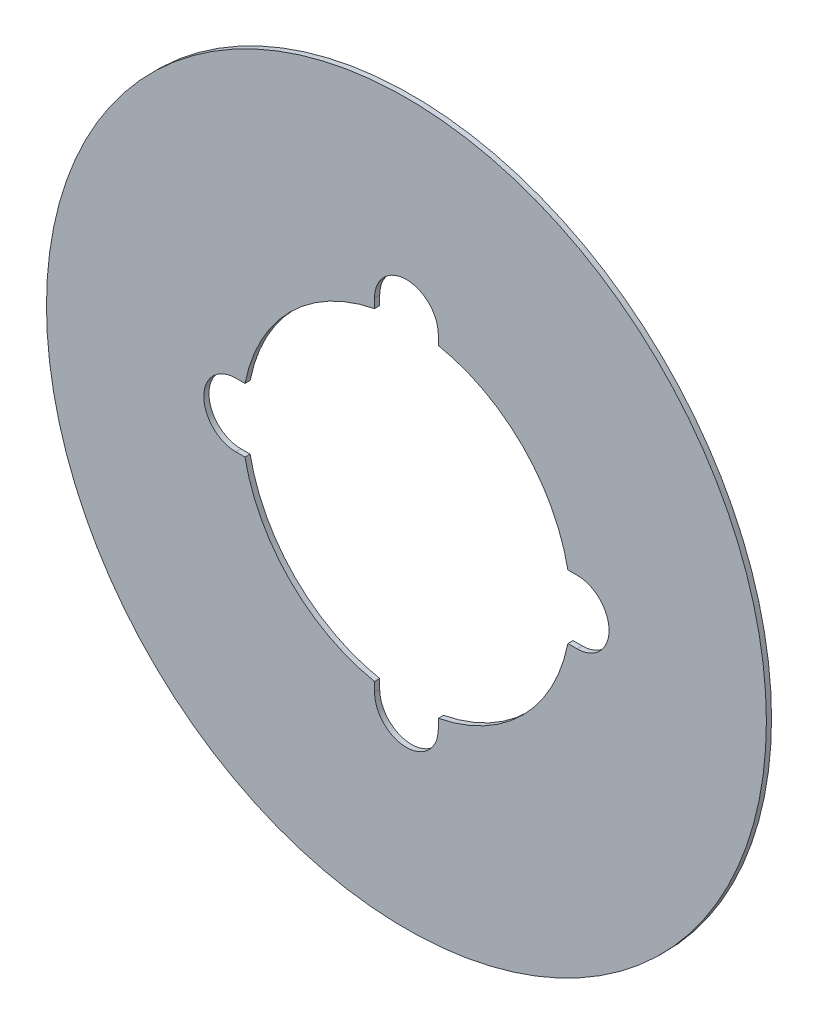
ISO-10303-21;
HEADER;
FILE_DESCRIPTION(('STEP AP214'),'2;1');
FILE_NAME('part.step','',(''),(''),'','','');
FILE_SCHEMA(('AUTOMOTIVE_DESIGN { 1 0 10303 214 1 1 1 1 }'));
ENDSEC;
DATA;
#1=APPLICATION_CONTEXT('core data for automotive mechanical design processes');
#2=APPLICATION_PROTOCOL_DEFINITION('international standard','automotive_design',2000,#1);
#3=PRODUCT_CONTEXT('',#1,'mechanical');
#4=PRODUCT('Part','Part','',(#3));
#5=PRODUCT_RELATED_PRODUCT_CATEGORY('part','',(#4));
#6=PRODUCT_DEFINITION_FORMATION('','',#4);
#7=PRODUCT_DEFINITION_CONTEXT('part definition',#1,'design');
#8=PRODUCT_DEFINITION('design','',#6,#7);
#9=PRODUCT_DEFINITION_SHAPE('','',#8);
#10=(LENGTH_UNIT() NAMED_UNIT(*) SI_UNIT(.MILLI.,.METRE.));
#11=(NAMED_UNIT(*) PLANE_ANGLE_UNIT() SI_UNIT($,.RADIAN.));
#12=(NAMED_UNIT(*) SI_UNIT($,.STERADIAN.) SOLID_ANGLE_UNIT());
#13=UNCERTAINTY_MEASURE_WITH_UNIT(LENGTH_MEASURE(1.E-05),#10,'distance_accuracy_value','');
#14=(GEOMETRIC_REPRESENTATION_CONTEXT(3) GLOBAL_UNCERTAINTY_ASSIGNED_CONTEXT((#13)) GLOBAL_UNIT_ASSIGNED_CONTEXT((#10,
#11,#12)) REPRESENTATION_CONTEXT('',''));
#15=CARTESIAN_POINT('',(0.,0.,0.));
#16=DIRECTION('',(0.,0.,1.));
#17=DIRECTION('',(1.,0.,0.));
#18=AXIS2_PLACEMENT_3D('',#15,#16,#17);
#19=CARTESIAN_POINT('',(0.,0.,0.25));
#20=DIRECTION('',(0.,0.,1.));
#21=DIRECTION('',(1.,0.,0.));
#22=AXIS2_PLACEMENT_3D('',#19,#20,#21);
#23=PLANE('',#22);
#24=CARTESIAN_POINT('',(0.,0.,0.25));
#25=DIRECTION('',(0.,0.,1.));
#26=DIRECTION('',(1.,0.,0.));
#27=AXIS2_PLACEMENT_3D('',#24,#25,#26);
#28=CIRCLE('',#27,17.5);
#29=CARTESIAN_POINT('',(17.5,0.,0.25));
#30=VERTEX_POINT('',#29);
#31=EDGE_CURVE('E11',#30,#30,#28,.T.);
#32=ORIENTED_EDGE('',*,*,#31,.T.);
#33=EDGE_LOOP('',(#32));
#34=FACE_BOUND('',#33,.T.);
#35=DIRECTION('',(1.,0.,0.));
#36=VECTOR('',#35,1.);
#37=CARTESIAN_POINT('',(-8.3,-1.55,0.25));
#38=LINE('',#37,#36);
#39=CARTESIAN_POINT('',(-8.3,-1.55,0.25));
#40=VERTEX_POINT('',#39);
#41=CARTESIAN_POINT('',(-7.84840748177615,-1.55,0.25));
#42=VERTEX_POINT('',#41);
#43=EDGE_CURVE('E138',#40,#42,#38,.T.);
#44=ORIENTED_EDGE('',*,*,#43,.F.);
#45=CARTESIAN_POINT('',(-8.3,0.,0.25));
#46=DIRECTION('',(0.,0.,1.));
#47=DIRECTION('',(1.,0.,0.));
#48=AXIS2_PLACEMENT_3D('',#45,#46,#47);
#49=CIRCLE('',#48,1.55);
#50=CARTESIAN_POINT('',(-8.3,1.55,0.25));
#51=VERTEX_POINT('',#50);
#52=EDGE_CURVE('E130',#51,#40,#49,.T.);
#53=ORIENTED_EDGE('',*,*,#52,.F.);
#54=DIRECTION('',(-1.,0.,0.));
#55=VECTOR('',#54,1.);
#56=CARTESIAN_POINT('',(-8.3,1.55,0.25));
#57=LINE('',#56,#55);
#58=CARTESIAN_POINT('',(-7.84840748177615,1.55,0.249999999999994));
#59=VERTEX_POINT('',#58);
#60=EDGE_CURVE('E178',#59,#51,#57,.T.);
#61=ORIENTED_EDGE('',*,*,#60,.F.);
#62=CARTESIAN_POINT('',(0.,0.,0.25));
#63=DIRECTION('',(0.,0.,1.));
#64=DIRECTION('',(1.,0.,0.));
#65=AXIS2_PLACEMENT_3D('',#62,#63,#64);
#66=CIRCLE('',#65,8.);
#67=CARTESIAN_POINT('',(-1.55,7.84840748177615,0.250000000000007));
#68=VERTEX_POINT('',#67);
#69=EDGE_CURVE('E176',#68,#59,#66,.T.);
#70=ORIENTED_EDGE('',*,*,#69,.F.);
#71=DIRECTION('',(0.,-1.,0.));
#72=VECTOR('',#71,1.);
#73=CARTESIAN_POINT('',(-1.55,8.3,0.25));
#74=LINE('',#73,#72);
#75=CARTESIAN_POINT('',(-1.55,8.3,0.25));
#76=VERTEX_POINT('',#75);
#77=EDGE_CURVE('E174',#76,#68,#74,.T.);
#78=ORIENTED_EDGE('',*,*,#77,.F.);
#79=CARTESIAN_POINT('',(0.,8.3,0.25));
#80=DIRECTION('',(0.,0.,1.));
#81=DIRECTION('',(1.,0.,0.));
#82=AXIS2_PLACEMENT_3D('',#79,#80,#81);
#83=CIRCLE('',#82,1.55);
#84=CARTESIAN_POINT('',(1.55,8.3,0.25));
#85=VERTEX_POINT('',#84);
#86=EDGE_CURVE('E172',#85,#76,#83,.T.);
#87=ORIENTED_EDGE('',*,*,#86,.F.);
#88=DIRECTION('',(0.,1.,0.));
#89=VECTOR('',#88,1.);
#90=CARTESIAN_POINT('',(1.55,8.3,0.25));
#91=LINE('',#90,#89);
#92=CARTESIAN_POINT('',(1.55,7.84840748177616,0.25));
#93=VERTEX_POINT('',#92);
#94=EDGE_CURVE('E170',#93,#85,#91,.T.);
#95=ORIENTED_EDGE('',*,*,#94,.F.);
#96=CARTESIAN_POINT('',(0.,0.,0.25));
#97=DIRECTION('',(0.,0.,1.));
#98=DIRECTION('',(1.,0.,0.));
#99=AXIS2_PLACEMENT_3D('',#96,#97,#98);
#100=CIRCLE('',#99,8.);
#101=CARTESIAN_POINT('',(7.84840748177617,1.55,0.249999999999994));
#102=VERTEX_POINT('',#101);
#103=EDGE_CURVE('E168',#102,#93,#100,.T.);
#104=ORIENTED_EDGE('',*,*,#103,.F.);
#105=DIRECTION('',(-1.,0.,0.));
#106=VECTOR('',#105,1.);
#107=CARTESIAN_POINT('',(7.84840748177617,1.55,0.249999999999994));
#108=LINE('',#107,#106);
#109=CARTESIAN_POINT('',(8.3,1.55,0.25));
#110=VERTEX_POINT('',#109);
#111=EDGE_CURVE('E166',#110,#102,#108,.T.);
#112=ORIENTED_EDGE('',*,*,#111,.F.);
#113=CARTESIAN_POINT('',(8.3,0.,0.250000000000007));
#114=DIRECTION('',(0.,0.,1.));
#115=DIRECTION('',(1.,0.,0.));
#116=AXIS2_PLACEMENT_3D('',#113,#114,#115);
#117=CIRCLE('',#116,1.55);
#118=CARTESIAN_POINT('',(8.3,-1.55,0.25));
#119=VERTEX_POINT('',#118);
#120=EDGE_CURVE('E164',#119,#110,#117,.T.);
#121=ORIENTED_EDGE('',*,*,#120,.F.);
#122=DIRECTION('',(1.,0.,0.));
#123=VECTOR('',#122,1.);
#124=CARTESIAN_POINT('',(7.84840748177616,-1.55,0.25));
#125=LINE('',#124,#123);
#126=CARTESIAN_POINT('',(7.84840748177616,-1.55,0.25));
#127=VERTEX_POINT('',#126);
#128=EDGE_CURVE('E162',#127,#119,#125,.T.);
#129=ORIENTED_EDGE('',*,*,#128,.F.);
#130=CARTESIAN_POINT('',(0.,0.,0.25));
#131=DIRECTION('',(0.,0.,1.));
#132=DIRECTION('',(1.,0.,0.));
#133=AXIS2_PLACEMENT_3D('',#130,#131,#132);
#134=CIRCLE('',#133,8.);
#135=CARTESIAN_POINT('',(1.55,-7.84840748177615,0.25));
#136=VERTEX_POINT('',#135);
#137=EDGE_CURVE('E160',#136,#127,#134,.T.);
#138=ORIENTED_EDGE('',*,*,#137,.F.);
#139=DIRECTION('',(0.,1.,0.));
#140=VECTOR('',#139,1.);
#141=CARTESIAN_POINT('',(1.55,-7.84840748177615,0.25));
#142=LINE('',#141,#140);
#143=CARTESIAN_POINT('',(1.55,-8.3,0.25));
#144=VERTEX_POINT('',#143);
#145=EDGE_CURVE('E158',#144,#136,#142,.T.);
#146=ORIENTED_EDGE('',*,*,#145,.F.);
#147=CARTESIAN_POINT('',(0.,-8.3,0.249999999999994));
#148=DIRECTION('',(0.,0.,1.));
#149=DIRECTION('',(1.,0.,0.));
#150=AXIS2_PLACEMENT_3D('',#147,#148,#149);
#151=CIRCLE('',#150,1.55);
#152=CARTESIAN_POINT('',(-1.55,-8.3,0.25));
#153=VERTEX_POINT('',#152);
#154=EDGE_CURVE('E156',#153,#144,#151,.T.);
#155=ORIENTED_EDGE('',*,*,#154,.F.);
#156=DIRECTION('',(0.,-1.,0.));
#157=VECTOR('',#156,1.);
#158=CARTESIAN_POINT('',(-1.55,-7.84840748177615,0.25));
#159=LINE('',#158,#157);
#160=CARTESIAN_POINT('',(-1.55,-7.84840748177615,0.25));
#161=VERTEX_POINT('',#160);
#162=EDGE_CURVE('E152',#161,#153,#159,.T.);
#163=ORIENTED_EDGE('',*,*,#162,.F.);
#164=CARTESIAN_POINT('',(0.,0.,0.25));
#165=DIRECTION('',(0.,0.,1.));
#166=DIRECTION('',(1.,0.,0.));
#167=AXIS2_PLACEMENT_3D('',#164,#165,#166);
#168=CIRCLE('',#167,8.);
#169=EDGE_CURVE('E150',#42,#161,#168,.T.);
#170=ORIENTED_EDGE('',*,*,#169,.F.);
#171=EDGE_LOOP('',(#44,#53,#61,#70,#78,#87,#95,#104,#112,#121,#129,#138,#146,#155,#163,#170));
#172=FACE_BOUND('',#171,.T.);
#173=ADVANCED_FACE('F17',(#34,#172),#23,.T.);
#174=CARTESIAN_POINT('',(0.,0.,0.));
#175=DIRECTION('',(0.,0.,1.));
#176=DIRECTION('',(1.,0.,0.));
#177=AXIS2_PLACEMENT_3D('',#174,#175,#176);
#178=PLANE('',#177);
#179=CARTESIAN_POINT('',(0.,0.,0.));
#180=DIRECTION('',(0.,0.,1.));
#181=DIRECTION('',(1.,0.,0.));
#182=AXIS2_PLACEMENT_3D('',#179,#180,#181);
#183=CIRCLE('',#182,17.5);
#184=CARTESIAN_POINT('',(17.5,0.,0.));
#185=VERTEX_POINT('',#184);
#186=EDGE_CURVE('E21',#185,#185,#183,.T.);
#187=ORIENTED_EDGE('',*,*,#186,.F.);
#188=EDGE_LOOP('',(#187));
#189=FACE_BOUND('',#188,.T.);
#190=CARTESIAN_POINT('',(-8.3,0.,0.));
#191=DIRECTION('',(0.,0.,1.));
#192=DIRECTION('',(1.,0.,0.));
#193=AXIS2_PLACEMENT_3D('',#190,#191,#192);
#194=CIRCLE('',#193,1.55);
#195=CARTESIAN_POINT('',(-8.3,1.55,0.));
#196=VERTEX_POINT('',#195);
#197=CARTESIAN_POINT('',(-8.3,-1.55,0.));
#198=VERTEX_POINT('',#197);
#199=EDGE_CURVE('E40',#196,#198,#194,.T.);
#200=ORIENTED_EDGE('',*,*,#199,.T.);
#201=DIRECTION('',(1.,0.,0.));
#202=VECTOR('',#201,1.);
#203=CARTESIAN_POINT('',(-8.3,-1.55,0.));
#204=LINE('',#203,#202);
#205=CARTESIAN_POINT('',(-7.84840748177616,-1.55,0.));
#206=VERTEX_POINT('',#205);
#207=EDGE_CURVE('E145',#198,#206,#204,.T.);
#208=ORIENTED_EDGE('',*,*,#207,.T.);
#209=CARTESIAN_POINT('',(0.,0.,0.));
#210=DIRECTION('',(0.,0.,1.));
#211=DIRECTION('',(1.,0.,0.));
#212=AXIS2_PLACEMENT_3D('',#209,#210,#211);
#213=CIRCLE('',#212,8.);
#214=CARTESIAN_POINT('',(-1.55,-7.84840748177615,0.));
#215=VERTEX_POINT('',#214);
#216=EDGE_CURVE('E182',#206,#215,#213,.T.);
#217=ORIENTED_EDGE('',*,*,#216,.T.);
#218=DIRECTION('',(0.,-1.,0.));
#219=VECTOR('',#218,1.);
#220=CARTESIAN_POINT('',(-1.55,-7.84840748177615,0.));
#221=LINE('',#220,#219);
#222=CARTESIAN_POINT('',(-1.55,-8.3,0.));
#223=VERTEX_POINT('',#222);
#224=EDGE_CURVE('E185',#215,#223,#221,.T.);
#225=ORIENTED_EDGE('',*,*,#224,.T.);
#226=CARTESIAN_POINT('',(0.,-8.3,0.));
#227=DIRECTION('',(0.,0.,1.));
#228=DIRECTION('',(1.,0.,0.));
#229=AXIS2_PLACEMENT_3D('',#226,#227,#228);
#230=CIRCLE('',#229,1.55);
#231=CARTESIAN_POINT('',(1.55,-8.3,0.));
#232=VERTEX_POINT('',#231);
#233=EDGE_CURVE('E188',#223,#232,#230,.T.);
#234=ORIENTED_EDGE('',*,*,#233,.T.);
#235=DIRECTION('',(0.,1.,0.));
#236=VECTOR('',#235,1.);
#237=CARTESIAN_POINT('',(1.55,-7.84840748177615,0.));
#238=LINE('',#237,#236);
#239=CARTESIAN_POINT('',(1.55,-7.84840748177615,0.));
#240=VERTEX_POINT('',#239);
#241=EDGE_CURVE('E191',#232,#240,#238,.T.);
#242=ORIENTED_EDGE('',*,*,#241,.T.);
#243=CARTESIAN_POINT('',(0.,0.,0.));
#244=DIRECTION('',(0.,0.,1.));
#245=DIRECTION('',(1.,0.,0.));
#246=AXIS2_PLACEMENT_3D('',#243,#244,#245);
#247=CIRCLE('',#246,8.);
#248=CARTESIAN_POINT('',(7.84840748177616,-1.55,0.));
#249=VERTEX_POINT('',#248);
#250=EDGE_CURVE('E194',#240,#249,#247,.T.);
#251=ORIENTED_EDGE('',*,*,#250,.T.);
#252=DIRECTION('',(1.,0.,0.));
#253=VECTOR('',#252,1.);
#254=CARTESIAN_POINT('',(7.84840748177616,-1.55,0.));
#255=LINE('',#254,#253);
#256=CARTESIAN_POINT('',(8.3,-1.55,0.));
#257=VERTEX_POINT('',#256);
#258=EDGE_CURVE('E197',#249,#257,#255,.T.);
#259=ORIENTED_EDGE('',*,*,#258,.T.);
#260=CARTESIAN_POINT('',(8.3,0.,0.));
#261=DIRECTION('',(0.,0.,1.));
#262=DIRECTION('',(1.,0.,0.));
#263=AXIS2_PLACEMENT_3D('',#260,#261,#262);
#264=CIRCLE('',#263,1.55);
#265=CARTESIAN_POINT('',(8.3,1.55,0.));
#266=VERTEX_POINT('',#265);
#267=EDGE_CURVE('E200',#257,#266,#264,.T.);
#268=ORIENTED_EDGE('',*,*,#267,.T.);
#269=DIRECTION('',(-1.,0.,0.));
#270=VECTOR('',#269,1.);
#271=CARTESIAN_POINT('',(7.84840748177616,1.55,0.));
#272=LINE('',#271,#270);
#273=CARTESIAN_POINT('',(7.84840748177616,1.55,0.));
#274=VERTEX_POINT('',#273);
#275=EDGE_CURVE('E203',#266,#274,#272,.T.);
#276=ORIENTED_EDGE('',*,*,#275,.T.);
#277=CARTESIAN_POINT('',(0.,0.,0.));
#278=DIRECTION('',(0.,0.,1.));
#279=DIRECTION('',(1.,0.,0.));
#280=AXIS2_PLACEMENT_3D('',#277,#278,#279);
#281=CIRCLE('',#280,8.);
#282=CARTESIAN_POINT('',(1.55,7.84840748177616,0.));
#283=VERTEX_POINT('',#282);
#284=EDGE_CURVE('E206',#274,#283,#281,.T.);
#285=ORIENTED_EDGE('',*,*,#284,.T.);
#286=DIRECTION('',(0.,1.,0.));
#287=VECTOR('',#286,1.);
#288=CARTESIAN_POINT('',(1.55,8.3,0.));
#289=LINE('',#288,#287);
#290=CARTESIAN_POINT('',(1.55,8.3,0.));
#291=VERTEX_POINT('',#290);
#292=EDGE_CURVE('E209',#283,#291,#289,.T.);
#293=ORIENTED_EDGE('',*,*,#292,.T.);
#294=CARTESIAN_POINT('',(0.,8.3,0.));
#295=DIRECTION('',(0.,0.,1.));
#296=DIRECTION('',(1.,0.,0.));
#297=AXIS2_PLACEMENT_3D('',#294,#295,#296);
#298=CIRCLE('',#297,1.55);
#299=CARTESIAN_POINT('',(-1.55,8.3,0.));
#300=VERTEX_POINT('',#299);
#301=EDGE_CURVE('E212',#291,#300,#298,.T.);
#302=ORIENTED_EDGE('',*,*,#301,.T.);
#303=DIRECTION('',(0.,-1.,0.));
#304=VECTOR('',#303,1.);
#305=CARTESIAN_POINT('',(-1.55,8.3,0.));
#306=LINE('',#305,#304);
#307=CARTESIAN_POINT('',(-1.55,7.84840748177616,0.));
#308=VERTEX_POINT('',#307);
#309=EDGE_CURVE('E215',#300,#308,#306,.T.);
#310=ORIENTED_EDGE('',*,*,#309,.T.);
#311=CARTESIAN_POINT('',(0.,0.,0.));
#312=DIRECTION('',(0.,0.,1.));
#313=DIRECTION('',(1.,0.,0.));
#314=AXIS2_PLACEMENT_3D('',#311,#312,#313);
#315=CIRCLE('',#314,8.);
#316=CARTESIAN_POINT('',(-7.84840748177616,1.55,0.));
#317=VERTEX_POINT('',#316);
#318=EDGE_CURVE('E218',#308,#317,#315,.T.);
#319=ORIENTED_EDGE('',*,*,#318,.T.);
#320=DIRECTION('',(-1.,0.,0.));
#321=VECTOR('',#320,1.);
#322=CARTESIAN_POINT('',(-8.3,1.55,0.));
#323=LINE('',#322,#321);
#324=EDGE_CURVE('E139',#317,#196,#323,.T.);
#325=ORIENTED_EDGE('',*,*,#324,.T.);
#326=EDGE_LOOP('',(#200,#208,#217,#225,#234,#242,#251,#259,#268,#276,#285,#293,#302,#310,#319,#325));
#327=FACE_BOUND('',#326,.T.);
#328=ADVANCED_FACE('F255',(#189,#327),#178,.F.);
#329=CARTESIAN_POINT('',(0.,0.,0.25));
#330=DIRECTION('',(0.,0.,-1.));
#331=DIRECTION('',(-1.,0.,0.));
#332=AXIS2_PLACEMENT_3D('',#329,#330,#331);
#333=CYLINDRICAL_SURFACE('',#332,17.5);
#334=ORIENTED_EDGE('',*,*,#31,.F.);
#335=EDGE_LOOP('',(#334));
#336=FACE_BOUND('',#335,.T.);
#337=ORIENTED_EDGE('',*,*,#186,.T.);
#338=EDGE_LOOP('',(#337));
#339=FACE_BOUND('',#338,.T.);
#340=ADVANCED_FACE('F19',(#336,#339),#333,.T.);
#341=CARTESIAN_POINT('',(-8.3,0.,0.25));
#342=DIRECTION('',(0.,0.,-1.));
#343=DIRECTION('',(-1.,0.,0.));
#344=AXIS2_PLACEMENT_3D('',#341,#342,#343);
#345=CYLINDRICAL_SURFACE('',#344,1.55);
#346=ORIENTED_EDGE('',*,*,#199,.F.);
#347=DIRECTION('',(0.,0.,-1.));
#348=VECTOR('',#347,1.);
#349=CARTESIAN_POINT('',(-8.3,1.55,0.25));
#350=LINE('',#349,#348);
#351=EDGE_CURVE('E134',#51,#196,#350,.T.);
#352=ORIENTED_EDGE('',*,*,#351,.F.);
#353=ORIENTED_EDGE('',*,*,#52,.T.);
#354=DIRECTION('',(0.,0.,-1.));
#355=VECTOR('',#354,1.);
#356=CARTESIAN_POINT('',(-8.3,-1.55,0.25));
#357=LINE('',#356,#355);
#358=EDGE_CURVE('E133',#40,#198,#357,.T.);
#359=ORIENTED_EDGE('',*,*,#358,.T.);
#360=EDGE_LOOP('',(#346,#352,#353,#359));
#361=FACE_BOUND('',#360,.T.);
#362=ADVANCED_FACE('F132',(#361),#345,.F.);
#363=CARTESIAN_POINT('',(-8.3,-1.55,0.25));
#364=DIRECTION('',(0.,1.,0.));
#365=DIRECTION('',(0.,0.,1.));
#366=AXIS2_PLACEMENT_3D('',#363,#364,#365);
#367=PLANE('',#366);
#368=ORIENTED_EDGE('',*,*,#207,.F.);
#369=ORIENTED_EDGE('',*,*,#358,.F.);
#370=ORIENTED_EDGE('',*,*,#43,.T.);
#371=DIRECTION('',(0.,0.,-1.));
#372=VECTOR('',#371,1.);
#373=CARTESIAN_POINT('',(-7.84840748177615,-1.55,0.25));
#374=LINE('',#373,#372);
#375=EDGE_CURVE('E146',#42,#206,#374,.T.);
#376=ORIENTED_EDGE('',*,*,#375,.T.);
#377=EDGE_LOOP('',(#368,#369,#370,#376));
#378=FACE_BOUND('',#377,.T.);
#379=ADVANCED_FACE('F142',(#378),#367,.T.);
#380=CARTESIAN_POINT('',(0.,0.,0.25));
#381=DIRECTION('',(0.,0.,-1.));
#382=DIRECTION('',(-1.,0.,0.));
#383=AXIS2_PLACEMENT_3D('',#380,#381,#382);
#384=CYLINDRICAL_SURFACE('',#383,8.);
#385=ORIENTED_EDGE('',*,*,#216,.F.);
#386=ORIENTED_EDGE('',*,*,#375,.F.);
#387=ORIENTED_EDGE('',*,*,#169,.T.);
#388=DIRECTION('',(0.,0.,-1.));
#389=VECTOR('',#388,1.);
#390=CARTESIAN_POINT('',(-1.55,-7.84840748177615,0.25));
#391=LINE('',#390,#389);
#392=EDGE_CURVE('E247',#161,#215,#391,.T.);
#393=ORIENTED_EDGE('',*,*,#392,.T.);
#394=EDGE_LOOP('',(#385,#386,#387,#393));
#395=FACE_BOUND('',#394,.T.);
#396=ADVANCED_FACE('F251',(#395),#384,.F.);
#397=CARTESIAN_POINT('',(-1.55,-7.84840748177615,0.25));
#398=DIRECTION('',(1.,0.,0.));
#399=DIRECTION('',(0.,1.,0.));
#400=AXIS2_PLACEMENT_3D('',#397,#398,#399);
#401=PLANE('',#400);
#402=ORIENTED_EDGE('',*,*,#224,.F.);
#403=ORIENTED_EDGE('',*,*,#392,.F.);
#404=ORIENTED_EDGE('',*,*,#162,.T.);
#405=DIRECTION('',(0.,0.,-1.));
#406=VECTOR('',#405,1.);
#407=CARTESIAN_POINT('',(-1.55,-8.3,0.25));
#408=LINE('',#407,#406);
#409=EDGE_CURVE('E245',#153,#223,#408,.T.);
#410=ORIENTED_EDGE('',*,*,#409,.T.);
#411=EDGE_LOOP('',(#402,#403,#404,#410));
#412=FACE_BOUND('',#411,.T.);
#413=ADVANCED_FACE('F313',(#412),#401,.T.);
#414=CARTESIAN_POINT('',(0.,-8.3,0.249999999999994));
#415=DIRECTION('',(0.,0.,-1.));
#416=DIRECTION('',(-1.,0.,0.));
#417=AXIS2_PLACEMENT_3D('',#414,#415,#416);
#418=CYLINDRICAL_SURFACE('',#417,1.55);
#419=ORIENTED_EDGE('',*,*,#233,.F.);
#420=ORIENTED_EDGE('',*,*,#409,.F.);
#421=ORIENTED_EDGE('',*,*,#154,.T.);
#422=DIRECTION('',(0.,0.,-1.));
#423=VECTOR('',#422,1.);
#424=CARTESIAN_POINT('',(1.55,-8.3,0.25));
#425=LINE('',#424,#423);
#426=EDGE_CURVE('E243',#144,#232,#425,.T.);
#427=ORIENTED_EDGE('',*,*,#426,.T.);
#428=EDGE_LOOP('',(#419,#420,#421,#427));
#429=FACE_BOUND('',#428,.T.);
#430=ADVANCED_FACE('F310',(#429),#418,.F.);
#431=CARTESIAN_POINT('',(1.55,-7.84840748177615,0.25));
#432=DIRECTION('',(-1.,0.,0.));
#433=DIRECTION('',(0.,0.,1.));
#434=AXIS2_PLACEMENT_3D('',#431,#432,#433);
#435=PLANE('',#434);
#436=ORIENTED_EDGE('',*,*,#241,.F.);
#437=ORIENTED_EDGE('',*,*,#426,.F.);
#438=ORIENTED_EDGE('',*,*,#145,.T.);
#439=DIRECTION('',(0.,0.,-1.));
#440=VECTOR('',#439,1.);
#441=CARTESIAN_POINT('',(1.55,-7.84840748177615,0.25));
#442=LINE('',#441,#440);
#443=EDGE_CURVE('E241',#136,#240,#442,.T.);
#444=ORIENTED_EDGE('',*,*,#443,.T.);
#445=EDGE_LOOP('',(#436,#437,#438,#444));
#446=FACE_BOUND('',#445,.T.);
#447=ADVANCED_FACE('F307',(#446),#435,.T.);
#448=CARTESIAN_POINT('',(0.,0.,0.25));
#449=DIRECTION('',(0.,0.,-1.));
#450=DIRECTION('',(-1.,0.,0.));
#451=AXIS2_PLACEMENT_3D('',#448,#449,#450);
#452=CYLINDRICAL_SURFACE('',#451,8.);
#453=ORIENTED_EDGE('',*,*,#250,.F.);
#454=ORIENTED_EDGE('',*,*,#443,.F.);
#455=ORIENTED_EDGE('',*,*,#137,.T.);
#456=DIRECTION('',(0.,0.,-1.));
#457=VECTOR('',#456,1.);
#458=CARTESIAN_POINT('',(7.84840748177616,-1.55,0.25));
#459=LINE('',#458,#457);
#460=EDGE_CURVE('E239',#127,#249,#459,.T.);
#461=ORIENTED_EDGE('',*,*,#460,.T.);
#462=EDGE_LOOP('',(#453,#454,#455,#461));
#463=FACE_BOUND('',#462,.T.);
#464=ADVANCED_FACE('F300',(#463),#452,.F.);
#465=CARTESIAN_POINT('',(7.84840748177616,-1.55,0.25));
#466=DIRECTION('',(0.,1.,0.));
#467=DIRECTION('',(0.,0.,1.));
#468=AXIS2_PLACEMENT_3D('',#465,#466,#467);
#469=PLANE('',#468);
#470=ORIENTED_EDGE('',*,*,#258,.F.);
#471=ORIENTED_EDGE('',*,*,#460,.F.);
#472=ORIENTED_EDGE('',*,*,#128,.T.);
#473=DIRECTION('',(0.,0.,-1.));
#474=VECTOR('',#473,1.);
#475=CARTESIAN_POINT('',(8.3,-1.55,0.25));
#476=LINE('',#475,#474);
#477=EDGE_CURVE('E237',#119,#257,#476,.T.);
#478=ORIENTED_EDGE('',*,*,#477,.T.);
#479=EDGE_LOOP('',(#470,#471,#472,#478));
#480=FACE_BOUND('',#479,.T.);
#481=ADVANCED_FACE('F296',(#480),#469,.T.);
#482=CARTESIAN_POINT('',(8.3,0.,0.250000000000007));
#483=DIRECTION('',(0.,0.,-1.));
#484=DIRECTION('',(-1.,0.,0.));
#485=AXIS2_PLACEMENT_3D('',#482,#483,#484);
#486=CYLINDRICAL_SURFACE('',#485,1.55);
#487=ORIENTED_EDGE('',*,*,#267,.F.);
#488=ORIENTED_EDGE('',*,*,#477,.F.);
#489=ORIENTED_EDGE('',*,*,#120,.T.);
#490=DIRECTION('',(0.,0.,-1.));
#491=VECTOR('',#490,1.);
#492=CARTESIAN_POINT('',(8.3,1.55,0.25));
#493=LINE('',#492,#491);
#494=EDGE_CURVE('E235',#110,#266,#493,.T.);
#495=ORIENTED_EDGE('',*,*,#494,.T.);
#496=EDGE_LOOP('',(#487,#488,#489,#495));
#497=FACE_BOUND('',#496,.T.);
#498=ADVANCED_FACE('F293',(#497),#486,.F.);
#499=CARTESIAN_POINT('',(7.84840748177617,1.55,0.249999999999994));
#500=DIRECTION('',(0.,-1.,0.));
#501=DIRECTION('',(1.,0.,0.));
#502=AXIS2_PLACEMENT_3D('',#499,#500,#501);
#503=PLANE('',#502);
#504=ORIENTED_EDGE('',*,*,#275,.F.);
#505=ORIENTED_EDGE('',*,*,#494,.F.);
#506=ORIENTED_EDGE('',*,*,#111,.T.);
#507=DIRECTION('',(0.,0.,-1.));
#508=VECTOR('',#507,1.);
#509=CARTESIAN_POINT('',(7.84840748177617,1.55,0.249999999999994));
#510=LINE('',#509,#508);
#511=EDGE_CURVE('E233',#102,#274,#510,.T.);
#512=ORIENTED_EDGE('',*,*,#511,.T.);
#513=EDGE_LOOP('',(#504,#505,#506,#512));
#514=FACE_BOUND('',#513,.T.);
#515=ADVANCED_FACE('F285',(#514),#503,.T.);
#516=CARTESIAN_POINT('',(0.,0.,0.25));
#517=DIRECTION('',(0.,0.,-1.));
#518=DIRECTION('',(-1.,0.,0.));
#519=AXIS2_PLACEMENT_3D('',#516,#517,#518);
#520=CYLINDRICAL_SURFACE('',#519,8.);
#521=ORIENTED_EDGE('',*,*,#284,.F.);
#522=ORIENTED_EDGE('',*,*,#511,.F.);
#523=ORIENTED_EDGE('',*,*,#103,.T.);
#524=DIRECTION('',(0.,0.,-1.));
#525=VECTOR('',#524,1.);
#526=CARTESIAN_POINT('',(1.55,7.84840748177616,0.25));
#527=LINE('',#526,#525);
#528=EDGE_CURVE('E231',#93,#283,#527,.T.);
#529=ORIENTED_EDGE('',*,*,#528,.T.);
#530=EDGE_LOOP('',(#521,#522,#523,#529));
#531=FACE_BOUND('',#530,.T.);
#532=ADVANCED_FACE('F281',(#531),#520,.F.);
#533=CARTESIAN_POINT('',(1.55,8.3,0.25));
#534=DIRECTION('',(-1.,0.,0.));
#535=DIRECTION('',(0.,0.,1.));
#536=AXIS2_PLACEMENT_3D('',#533,#534,#535);
#537=PLANE('',#536);
#538=ORIENTED_EDGE('',*,*,#292,.F.);
#539=ORIENTED_EDGE('',*,*,#528,.F.);
#540=ORIENTED_EDGE('',*,*,#94,.T.);
#541=DIRECTION('',(0.,0.,-1.));
#542=VECTOR('',#541,1.);
#543=CARTESIAN_POINT('',(1.55,8.3,0.25));
#544=LINE('',#543,#542);
#545=EDGE_CURVE('E229',#85,#291,#544,.T.);
#546=ORIENTED_EDGE('',*,*,#545,.T.);
#547=EDGE_LOOP('',(#538,#539,#540,#546));
#548=FACE_BOUND('',#547,.T.);
#549=ADVANCED_FACE('F278',(#548),#537,.T.);
#550=CARTESIAN_POINT('',(0.,8.3,0.25));
#551=DIRECTION('',(0.,0.,-1.));
#552=DIRECTION('',(-1.,0.,0.));
#553=AXIS2_PLACEMENT_3D('',#550,#551,#552);
#554=CYLINDRICAL_SURFACE('',#553,1.55);
#555=ORIENTED_EDGE('',*,*,#301,.F.);
#556=ORIENTED_EDGE('',*,*,#545,.F.);
#557=ORIENTED_EDGE('',*,*,#86,.T.);
#558=DIRECTION('',(0.,0.,-1.));
#559=VECTOR('',#558,1.);
#560=CARTESIAN_POINT('',(-1.55,8.3,0.25));
#561=LINE('',#560,#559);
#562=EDGE_CURVE('E227',#76,#300,#561,.T.);
#563=ORIENTED_EDGE('',*,*,#562,.T.);
#564=EDGE_LOOP('',(#555,#556,#557,#563));
#565=FACE_BOUND('',#564,.T.);
#566=ADVANCED_FACE('F270',(#565),#554,.F.);
#567=CARTESIAN_POINT('',(-1.55,8.3,0.25));
#568=DIRECTION('',(1.,0.,0.));
#569=DIRECTION('',(0.,0.,-1.));
#570=AXIS2_PLACEMENT_3D('',#567,#568,#569);
#571=PLANE('',#570);
#572=ORIENTED_EDGE('',*,*,#309,.F.);
#573=ORIENTED_EDGE('',*,*,#562,.F.);
#574=ORIENTED_EDGE('',*,*,#77,.T.);
#575=DIRECTION('',(0.,0.,-1.));
#576=VECTOR('',#575,1.);
#577=CARTESIAN_POINT('',(-1.55,7.84840748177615,0.250000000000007));
#578=LINE('',#577,#576);
#579=EDGE_CURVE('E225',#68,#308,#578,.T.);
#580=ORIENTED_EDGE('',*,*,#579,.T.);
#581=EDGE_LOOP('',(#572,#573,#574,#580));
#582=FACE_BOUND('',#581,.T.);
#583=ADVANCED_FACE('F266',(#582),#571,.T.);
#584=CARTESIAN_POINT('',(0.,0.,0.25));
#585=DIRECTION('',(0.,0.,-1.));
#586=DIRECTION('',(-1.,0.,0.));
#587=AXIS2_PLACEMENT_3D('',#584,#585,#586);
#588=CYLINDRICAL_SURFACE('',#587,8.);
#589=ORIENTED_EDGE('',*,*,#318,.F.);
#590=ORIENTED_EDGE('',*,*,#579,.F.);
#591=ORIENTED_EDGE('',*,*,#69,.T.);
#592=DIRECTION('',(0.,0.,-1.));
#593=VECTOR('',#592,1.);
#594=CARTESIAN_POINT('',(-7.84840748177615,1.55,0.249999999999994));
#595=LINE('',#594,#593);
#596=EDGE_CURVE('E32',#59,#317,#595,.T.);
#597=ORIENTED_EDGE('',*,*,#596,.T.);
#598=EDGE_LOOP('',(#589,#590,#591,#597));
#599=FACE_BOUND('',#598,.T.);
#600=ADVANCED_FACE('F263',(#599),#588,.F.);
#601=CARTESIAN_POINT('',(-8.3,1.55,0.25));
#602=DIRECTION('',(0.,-1.,0.));
#603=DIRECTION('',(0.,0.,-1.));
#604=AXIS2_PLACEMENT_3D('',#601,#602,#603);
#605=PLANE('',#604);
#606=ORIENTED_EDGE('',*,*,#324,.F.);
#607=ORIENTED_EDGE('',*,*,#596,.F.);
#608=ORIENTED_EDGE('',*,*,#60,.T.);
#609=ORIENTED_EDGE('',*,*,#351,.T.);
#610=EDGE_LOOP('',(#606,#607,#608,#609));
#611=FACE_BOUND('',#610,.T.);
#612=ADVANCED_FACE('F257',(#611),#605,.T.);
#613=CLOSED_SHELL('',(#173,#328,#340,#362,#379,#396,#413,#430,#447,#464,#481,#498,#515,#532,
#549,#566,#583,#600,#612));
#614=MANIFOLD_SOLID_BREP('B1',#613);
#615=ADVANCED_BREP_SHAPE_REPRESENTATION('',(#18,#614),#14);
#616=SHAPE_DEFINITION_REPRESENTATION(#9,#615);
ENDSEC;
END-ISO-10303-21;
